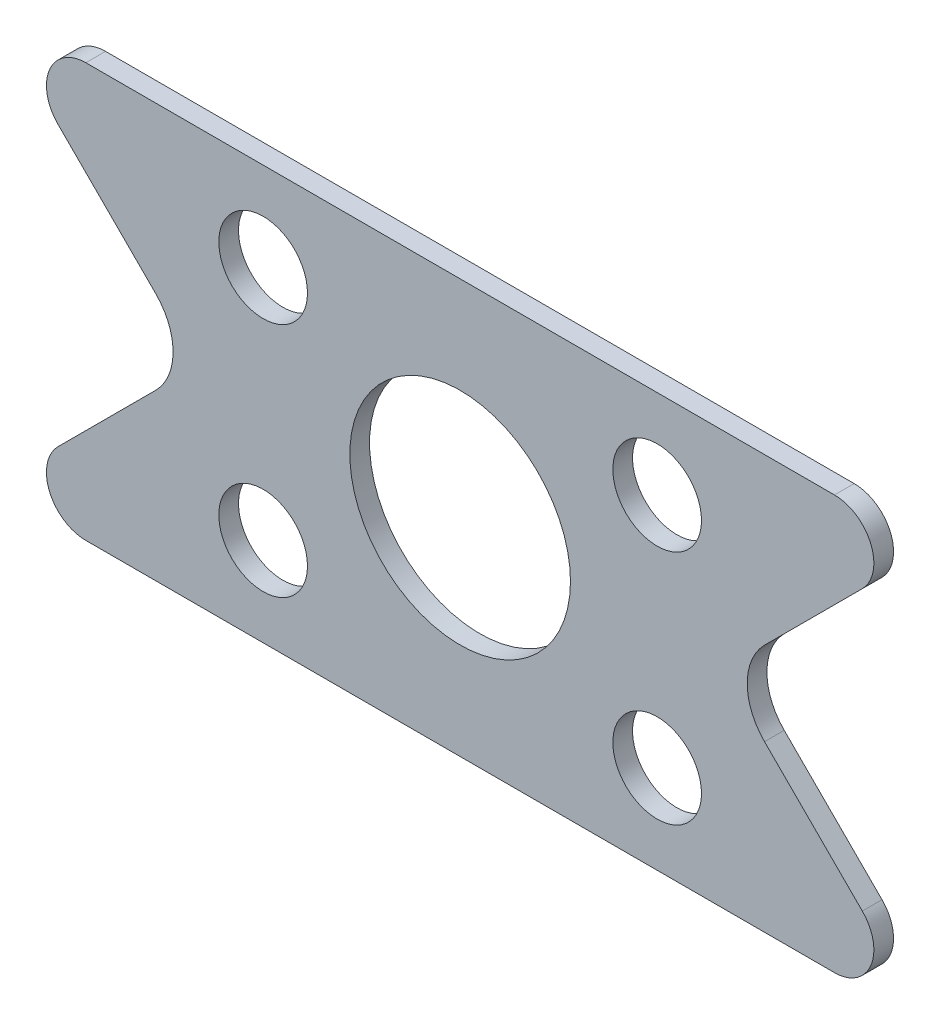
ISO-10303-21;
HEADER;
FILE_DESCRIPTION(('STEP AP214'),'2;1');
FILE_NAME('part.step','',(''),(''),'','','');
FILE_SCHEMA(('AUTOMOTIVE_DESIGN { 1 0 10303 214 1 1 1 1 }'));
ENDSEC;
DATA;
#1=APPLICATION_CONTEXT('core data for automotive mechanical design processes');
#2=APPLICATION_PROTOCOL_DEFINITION('international standard','automotive_design',2000,#1);
#3=PRODUCT_CONTEXT('',#1,'mechanical');
#4=PRODUCT('Part','Part','',(#3));
#5=PRODUCT_RELATED_PRODUCT_CATEGORY('part','',(#4));
#6=PRODUCT_DEFINITION_FORMATION('','',#4);
#7=PRODUCT_DEFINITION_CONTEXT('part definition',#1,'design');
#8=PRODUCT_DEFINITION('design','',#6,#7);
#9=PRODUCT_DEFINITION_SHAPE('','',#8);
#10=(LENGTH_UNIT() NAMED_UNIT(*) SI_UNIT(.MILLI.,.METRE.));
#11=(NAMED_UNIT(*) PLANE_ANGLE_UNIT() SI_UNIT($,.RADIAN.));
#12=(NAMED_UNIT(*) SI_UNIT($,.STERADIAN.) SOLID_ANGLE_UNIT());
#13=UNCERTAINTY_MEASURE_WITH_UNIT(LENGTH_MEASURE(1.E-05),#10,'distance_accuracy_value','');
#14=(GEOMETRIC_REPRESENTATION_CONTEXT(3) GLOBAL_UNCERTAINTY_ASSIGNED_CONTEXT((#13)) GLOBAL_UNIT_ASSIGNED_CONTEXT((#10,
#11,#12)) REPRESENTATION_CONTEXT('',''));
#15=CARTESIAN_POINT('',(0.,0.,0.));
#16=DIRECTION('',(0.,0.,1.));
#17=DIRECTION('',(1.,0.,0.));
#18=AXIS2_PLACEMENT_3D('',#15,#16,#17);
#19=CARTESIAN_POINT('',(-210.,-105.,10.));
#20=DIRECTION('',(0.,1.,0.));
#21=DIRECTION('',(0.,0.,1.));
#22=AXIS2_PLACEMENT_3D('',#19,#20,#21);
#23=PLANE('',#22);
#24=DIRECTION('',(0.,0.,1.));
#25=VECTOR('',#24,1.);
#26=CARTESIAN_POINT('',(-190.,-105.,0.));
#27=LINE('',#26,#25);
#28=CARTESIAN_POINT('',(-190.,-105.,0.));
#29=VERTEX_POINT('',#28);
#30=CARTESIAN_POINT('',(-190.,-105.,10.));
#31=VERTEX_POINT('',#30);
#32=EDGE_CURVE('E167',#29,#31,#27,.T.);
#33=ORIENTED_EDGE('',*,*,#32,.F.);
#34=DIRECTION('',(1.,0.,0.));
#35=VECTOR('',#34,1.);
#36=CARTESIAN_POINT('',(-210.,-105.,0.));
#37=LINE('',#36,#35);
#38=CARTESIAN_POINT('',(190.,-105.,0.));
#39=VERTEX_POINT('',#38);
#40=EDGE_CURVE('E242',#29,#39,#37,.T.);
#41=ORIENTED_EDGE('',*,*,#40,.T.);
#42=DIRECTION('',(0.,0.,1.));
#43=VECTOR('',#42,1.);
#44=CARTESIAN_POINT('',(190.,-105.,0.));
#45=LINE('',#44,#43);
#46=CARTESIAN_POINT('',(190.,-105.,10.));
#47=VERTEX_POINT('',#46);
#48=EDGE_CURVE('E208',#39,#47,#45,.T.);
#49=ORIENTED_EDGE('',*,*,#48,.T.);
#50=DIRECTION('',(1.,0.,0.));
#51=VECTOR('',#50,1.);
#52=CARTESIAN_POINT('',(-210.,-105.,10.));
#53=LINE('',#52,#51);
#54=EDGE_CURVE('E38',#31,#47,#53,.T.);
#55=ORIENTED_EDGE('',*,*,#54,.F.);
#56=EDGE_LOOP('',(#33,#41,#49,#55));
#57=FACE_BOUND('',#56,.T.);
#58=ADVANCED_FACE('F30',(#57),#23,.F.);
#59=CARTESIAN_POINT('',(-210.,-105.,10.));
#60=DIRECTION('',(0.,0.,-1.));
#61=DIRECTION('',(-1.,0.,0.));
#62=AXIS2_PLACEMENT_3D('',#59,#60,#61);
#63=PLANE('',#62);
#64=CARTESIAN_POINT('',(-100.,60.,10.));
#65=DIRECTION('',(0.,0.,1.));
#66=DIRECTION('',(1.,0.,0.));
#67=AXIS2_PLACEMENT_3D('',#64,#65,#66);
#68=CIRCLE('',#67,22.5);
#69=CARTESIAN_POINT('',(-77.5,60.,10.));
#70=VERTEX_POINT('',#69);
#71=EDGE_CURVE('E215',#70,#70,#68,.T.);
#72=ORIENTED_EDGE('',*,*,#71,.F.);
#73=EDGE_LOOP('',(#72));
#74=FACE_BOUND('',#73,.T.);
#75=CARTESIAN_POINT('',(100.,-60.,10.));
#76=DIRECTION('',(0.,0.,1.));
#77=DIRECTION('',(1.,0.,0.));
#78=AXIS2_PLACEMENT_3D('',#75,#76,#77);
#79=CIRCLE('',#78,22.5);
#80=CARTESIAN_POINT('',(122.5,-60.,10.));
#81=VERTEX_POINT('',#80);
#82=EDGE_CURVE('E227',#81,#81,#79,.T.);
#83=ORIENTED_EDGE('',*,*,#82,.F.);
#84=EDGE_LOOP('',(#83));
#85=FACE_BOUND('',#84,.T.);
#86=CARTESIAN_POINT('',(0.,0.,10.));
#87=DIRECTION('',(0.,0.,1.));
#88=DIRECTION('',(1.,0.,0.));
#89=AXIS2_PLACEMENT_3D('',#86,#87,#88);
#90=CIRCLE('',#89,56.);
#91=CARTESIAN_POINT('',(56.,0.,10.));
#92=VERTEX_POINT('',#91);
#93=EDGE_CURVE('E239',#92,#92,#90,.T.);
#94=ORIENTED_EDGE('',*,*,#93,.F.);
#95=EDGE_LOOP('',(#94));
#96=FACE_BOUND('',#95,.T.);
#97=CARTESIAN_POINT('',(100.,60.,10.));
#98=DIRECTION('',(0.,0.,1.));
#99=DIRECTION('',(1.,0.,0.));
#100=AXIS2_PLACEMENT_3D('',#97,#98,#99);
#101=CIRCLE('',#100,22.5);
#102=CARTESIAN_POINT('',(122.5,60.,10.));
#103=VERTEX_POINT('',#102);
#104=EDGE_CURVE('E233',#103,#103,#101,.T.);
#105=ORIENTED_EDGE('',*,*,#104,.F.);
#106=EDGE_LOOP('',(#105));
#107=FACE_BOUND('',#106,.T.);
#108=CARTESIAN_POINT('',(-100.,-60.,10.));
#109=DIRECTION('',(0.,0.,1.));
#110=DIRECTION('',(1.,0.,0.));
#111=AXIS2_PLACEMENT_3D('',#108,#109,#110);
#112=CIRCLE('',#111,22.5);
#113=CARTESIAN_POINT('',(-77.5,-60.,10.));
#114=VERTEX_POINT('',#113);
#115=EDGE_CURVE('E221',#114,#114,#112,.T.);
#116=ORIENTED_EDGE('',*,*,#115,.F.);
#117=EDGE_LOOP('',(#116));
#118=FACE_BOUND('',#117,.T.);
#119=CARTESIAN_POINT('',(-190.,-85.,10.));
#120=DIRECTION('',(0.,0.,1.));
#121=DIRECTION('',(-1.,0.,0.));
#122=AXIS2_PLACEMENT_3D('',#119,#120,#121);
#123=CIRCLE('',#122,19.9999999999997);
#124=CARTESIAN_POINT('',(-204.142135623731,-70.8578643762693,10.));
#125=VERTEX_POINT('',#124);
#126=EDGE_CURVE('E150',#125,#31,#123,.T.);
#127=ORIENTED_EDGE('',*,*,#126,.T.);
#128=ORIENTED_EDGE('',*,*,#54,.T.);
#129=CARTESIAN_POINT('',(190.,-85.,10.));
#130=DIRECTION('',(0.,0.,-1.));
#131=DIRECTION('',(1.,0.,0.));
#132=AXIS2_PLACEMENT_3D('',#129,#130,#131);
#133=CIRCLE('',#132,19.9999999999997);
#134=CARTESIAN_POINT('',(204.142135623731,-70.8578643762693,10.));
#135=VERTEX_POINT('',#134);
#136=EDGE_CURVE('E193',#135,#47,#133,.T.);
#137=ORIENTED_EDGE('',*,*,#136,.F.);
#138=DIRECTION('',(0.707106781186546,-0.707106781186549,0.));
#139=VECTOR('',#138,1.);
#140=CARTESIAN_POINT('',(154.497474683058,-21.2132034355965,10.));
#141=LINE('',#140,#139);
#142=CARTESIAN_POINT('',(154.497474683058,-21.2132034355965,10.));
#143=VERTEX_POINT('',#142);
#144=EDGE_CURVE('E190',#143,#135,#141,.T.);
#145=ORIENTED_EDGE('',*,*,#144,.F.);
#146=CARTESIAN_POINT('',(175.710678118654,-1.43982048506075E-13,10.));
#147=DIRECTION('',(0.,0.,1.));
#148=DIRECTION('',(1.,0.,0.));
#149=AXIS2_PLACEMENT_3D('',#146,#147,#148);
#150=CIRCLE('',#149,30.);
#151=CARTESIAN_POINT('',(154.497474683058,21.2132034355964,10.));
#152=VERTEX_POINT('',#151);
#153=EDGE_CURVE('E164',#152,#143,#150,.T.);
#154=ORIENTED_EDGE('',*,*,#153,.F.);
#155=DIRECTION('',(-0.707106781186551,-0.707106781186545,0.));
#156=VECTOR('',#155,1.);
#157=CARTESIAN_POINT('',(204.142135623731,70.8578643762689,10.));
#158=LINE('',#157,#156);
#159=CARTESIAN_POINT('',(204.142135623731,70.8578643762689,10.));
#160=VERTEX_POINT('',#159);
#161=EDGE_CURVE('E177',#160,#152,#158,.T.);
#162=ORIENTED_EDGE('',*,*,#161,.F.);
#163=CARTESIAN_POINT('',(190.,85.,10.));
#164=DIRECTION('',(0.,0.,-1.));
#165=DIRECTION('',(1.,0.,0.));
#166=AXIS2_PLACEMENT_3D('',#163,#164,#165);
#167=CIRCLE('',#166,20.);
#168=CARTESIAN_POINT('',(190.,105.,10.));
#169=VERTEX_POINT('',#168);
#170=EDGE_CURVE('E196',#169,#160,#167,.T.);
#171=ORIENTED_EDGE('',*,*,#170,.F.);
#172=DIRECTION('',(-1.,0.,0.));
#173=VECTOR('',#172,1.);
#174=CARTESIAN_POINT('',(-210.,105.,10.));
#175=LINE('',#174,#173);
#176=CARTESIAN_POINT('',(-190.,105.,10.));
#177=VERTEX_POINT('',#176);
#178=EDGE_CURVE('E11',#169,#177,#175,.T.);
#179=ORIENTED_EDGE('',*,*,#178,.T.);
#180=CARTESIAN_POINT('',(-190.,85.,10.));
#181=DIRECTION('',(0.,0.,1.));
#182=DIRECTION('',(-1.,0.,0.));
#183=AXIS2_PLACEMENT_3D('',#180,#181,#182);
#184=CIRCLE('',#183,20.);
#185=CARTESIAN_POINT('',(-204.142135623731,70.8578643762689,10.));
#186=VERTEX_POINT('',#185);
#187=EDGE_CURVE('E46',#177,#186,#184,.T.);
#188=ORIENTED_EDGE('',*,*,#187,.T.);
#189=DIRECTION('',(0.707106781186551,-0.707106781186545,0.));
#190=VECTOR('',#189,1.);
#191=CARTESIAN_POINT('',(-204.142135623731,70.8578643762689,10.));
#192=LINE('',#191,#190);
#193=CARTESIAN_POINT('',(-154.497474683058,21.2132034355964,10.));
#194=VERTEX_POINT('',#193);
#195=EDGE_CURVE('E158',#186,#194,#192,.T.);
#196=ORIENTED_EDGE('',*,*,#195,.T.);
#197=CARTESIAN_POINT('',(-175.710678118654,-1.43982048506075E-13,10.));
#198=DIRECTION('',(0.,0.,-1.));
#199=DIRECTION('',(-1.,0.,0.));
#200=AXIS2_PLACEMENT_3D('',#197,#198,#199);
#201=CIRCLE('',#200,30.);
#202=CARTESIAN_POINT('',(-154.497474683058,-21.2132034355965,10.));
#203=VERTEX_POINT('',#202);
#204=EDGE_CURVE('E139',#194,#203,#201,.T.);
#205=ORIENTED_EDGE('',*,*,#204,.T.);
#206=DIRECTION('',(-0.707106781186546,-0.707106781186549,0.));
#207=VECTOR('',#206,1.);
#208=CARTESIAN_POINT('',(-154.497474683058,-21.2132034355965,10.));
#209=LINE('',#208,#207);
#210=EDGE_CURVE('E147',#203,#125,#209,.T.);
#211=ORIENTED_EDGE('',*,*,#210,.T.);
#212=EDGE_LOOP('',(#127,#128,#137,#145,#154,#162,#171,#179,#188,#196,#205,#211));
#213=FACE_BOUND('',#212,.T.);
#214=ADVANCED_FACE('F255',(#74,#85,#96,#107,#118,#213),#63,.F.);
#215=CARTESIAN_POINT('',(-210.,-105.,0.));
#216=DIRECTION('',(0.,0.,-1.));
#217=DIRECTION('',(-1.,0.,0.));
#218=AXIS2_PLACEMENT_3D('',#215,#216,#217);
#219=PLANE('',#218);
#220=CARTESIAN_POINT('',(-100.,60.,0.));
#221=DIRECTION('',(0.,0.,1.));
#222=DIRECTION('',(1.,0.,0.));
#223=AXIS2_PLACEMENT_3D('',#220,#221,#222);
#224=CIRCLE('',#223,22.5);
#225=CARTESIAN_POINT('',(-77.5,60.,0.));
#226=VERTEX_POINT('',#225);
#227=EDGE_CURVE('E202',#226,#226,#224,.T.);
#228=ORIENTED_EDGE('',*,*,#227,.T.);
#229=EDGE_LOOP('',(#228));
#230=FACE_BOUND('',#229,.T.);
#231=CARTESIAN_POINT('',(100.,-60.,0.));
#232=DIRECTION('',(0.,0.,1.));
#233=DIRECTION('',(1.,0.,0.));
#234=AXIS2_PLACEMENT_3D('',#231,#232,#233);
#235=CIRCLE('',#234,22.5);
#236=CARTESIAN_POINT('',(122.5,-60.,0.));
#237=VERTEX_POINT('',#236);
#238=EDGE_CURVE('E224',#237,#237,#235,.T.);
#239=ORIENTED_EDGE('',*,*,#238,.T.);
#240=EDGE_LOOP('',(#239));
#241=FACE_BOUND('',#240,.T.);
#242=CARTESIAN_POINT('',(0.,0.,0.));
#243=DIRECTION('',(0.,0.,1.));
#244=DIRECTION('',(1.,0.,0.));
#245=AXIS2_PLACEMENT_3D('',#242,#243,#244);
#246=CIRCLE('',#245,56.);
#247=CARTESIAN_POINT('',(56.,0.,0.));
#248=VERTEX_POINT('',#247);
#249=EDGE_CURVE('E236',#248,#248,#246,.T.);
#250=ORIENTED_EDGE('',*,*,#249,.T.);
#251=EDGE_LOOP('',(#250));
#252=FACE_BOUND('',#251,.T.);
#253=CARTESIAN_POINT('',(100.,60.,0.));
#254=DIRECTION('',(0.,0.,1.));
#255=DIRECTION('',(1.,0.,0.));
#256=AXIS2_PLACEMENT_3D('',#253,#254,#255);
#257=CIRCLE('',#256,22.5);
#258=CARTESIAN_POINT('',(122.5,60.,0.));
#259=VERTEX_POINT('',#258);
#260=EDGE_CURVE('E230',#259,#259,#257,.T.);
#261=ORIENTED_EDGE('',*,*,#260,.T.);
#262=EDGE_LOOP('',(#261));
#263=FACE_BOUND('',#262,.T.);
#264=CARTESIAN_POINT('',(-100.,-60.,0.));
#265=DIRECTION('',(0.,0.,1.));
#266=DIRECTION('',(1.,0.,0.));
#267=AXIS2_PLACEMENT_3D('',#264,#265,#266);
#268=CIRCLE('',#267,22.5);
#269=CARTESIAN_POINT('',(-77.5,-60.,0.));
#270=VERTEX_POINT('',#269);
#271=EDGE_CURVE('E218',#270,#270,#268,.T.);
#272=ORIENTED_EDGE('',*,*,#271,.T.);
#273=EDGE_LOOP('',(#272));
#274=FACE_BOUND('',#273,.T.);
#275=ORIENTED_EDGE('',*,*,#40,.F.);
#276=CARTESIAN_POINT('',(-190.,-85.,0.));
#277=DIRECTION('',(0.,0.,1.));
#278=DIRECTION('',(-1.,0.,0.));
#279=AXIS2_PLACEMENT_3D('',#276,#277,#278);
#280=CIRCLE('',#279,19.9999999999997);
#281=CARTESIAN_POINT('',(-204.142135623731,-70.8578643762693,0.));
#282=VERTEX_POINT('',#281);
#283=EDGE_CURVE('E154',#282,#29,#280,.T.);
#284=ORIENTED_EDGE('',*,*,#283,.F.);
#285=DIRECTION('',(-0.707106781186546,-0.707106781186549,0.));
#286=VECTOR('',#285,1.);
#287=CARTESIAN_POINT('',(-154.497474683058,-21.2132034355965,0.));
#288=LINE('',#287,#286);
#289=CARTESIAN_POINT('',(-154.497474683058,-21.2132034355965,0.));
#290=VERTEX_POINT('',#289);
#291=EDGE_CURVE('E141',#290,#282,#288,.T.);
#292=ORIENTED_EDGE('',*,*,#291,.F.);
#293=CARTESIAN_POINT('',(-175.710678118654,-1.43982048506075E-13,0.));
#294=DIRECTION('',(0.,0.,-1.));
#295=DIRECTION('',(-1.,0.,0.));
#296=AXIS2_PLACEMENT_3D('',#293,#294,#295);
#297=CIRCLE('',#296,30.);
#298=CARTESIAN_POINT('',(-154.497474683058,21.2132034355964,0.));
#299=VERTEX_POINT('',#298);
#300=EDGE_CURVE('E132',#299,#290,#297,.T.);
#301=ORIENTED_EDGE('',*,*,#300,.F.);
#302=DIRECTION('',(0.707106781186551,-0.707106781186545,0.));
#303=VECTOR('',#302,1.);
#304=CARTESIAN_POINT('',(-204.142135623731,70.8578643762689,0.));
#305=LINE('',#304,#303);
#306=CARTESIAN_POINT('',(-204.142135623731,70.8578643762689,0.));
#307=VERTEX_POINT('',#306);
#308=EDGE_CURVE('E121',#307,#299,#305,.T.);
#309=ORIENTED_EDGE('',*,*,#308,.F.);
#310=CARTESIAN_POINT('',(-190.,85.,0.));
#311=DIRECTION('',(0.,0.,1.));
#312=DIRECTION('',(-1.,0.,0.));
#313=AXIS2_PLACEMENT_3D('',#310,#311,#312);
#314=CIRCLE('',#313,20.);
#315=CARTESIAN_POINT('',(-190.,105.,0.));
#316=VERTEX_POINT('',#315);
#317=EDGE_CURVE('E131',#316,#307,#314,.T.);
#318=ORIENTED_EDGE('',*,*,#317,.F.);
#319=DIRECTION('',(-1.,0.,0.));
#320=VECTOR('',#319,1.);
#321=CARTESIAN_POINT('',(-210.,105.,0.));
#322=LINE('',#321,#320);
#323=CARTESIAN_POINT('',(190.,105.,0.));
#324=VERTEX_POINT('',#323);
#325=EDGE_CURVE('E33',#324,#316,#322,.T.);
#326=ORIENTED_EDGE('',*,*,#325,.F.);
#327=CARTESIAN_POINT('',(190.,85.,0.));
#328=DIRECTION('',(0.,0.,-1.));
#329=DIRECTION('',(1.,0.,0.));
#330=AXIS2_PLACEMENT_3D('',#327,#328,#329);
#331=CIRCLE('',#330,20.);
#332=CARTESIAN_POINT('',(204.142135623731,70.8578643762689,0.));
#333=VERTEX_POINT('',#332);
#334=EDGE_CURVE('E54',#324,#333,#331,.T.);
#335=ORIENTED_EDGE('',*,*,#334,.T.);
#336=DIRECTION('',(-0.707106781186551,-0.707106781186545,0.));
#337=VECTOR('',#336,1.);
#338=CARTESIAN_POINT('',(204.142135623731,70.8578643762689,0.));
#339=LINE('',#338,#337);
#340=CARTESIAN_POINT('',(154.497474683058,21.2132034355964,0.));
#341=VERTEX_POINT('',#340);
#342=EDGE_CURVE('E184',#333,#341,#339,.T.);
#343=ORIENTED_EDGE('',*,*,#342,.T.);
#344=CARTESIAN_POINT('',(175.710678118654,-1.43982048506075E-13,0.));
#345=DIRECTION('',(0.,0.,1.));
#346=DIRECTION('',(1.,0.,0.));
#347=AXIS2_PLACEMENT_3D('',#344,#345,#346);
#348=CIRCLE('',#347,30.);
#349=CARTESIAN_POINT('',(154.497474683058,-21.2132034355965,0.));
#350=VERTEX_POINT('',#349);
#351=EDGE_CURVE('E173',#341,#350,#348,.T.);
#352=ORIENTED_EDGE('',*,*,#351,.T.);
#353=DIRECTION('',(0.707106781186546,-0.707106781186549,0.));
#354=VECTOR('',#353,1.);
#355=CARTESIAN_POINT('',(154.497474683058,-21.2132034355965,0.));
#356=LINE('',#355,#354);
#357=CARTESIAN_POINT('',(204.142135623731,-70.8578643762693,0.));
#358=VERTEX_POINT('',#357);
#359=EDGE_CURVE('E176',#350,#358,#356,.T.);
#360=ORIENTED_EDGE('',*,*,#359,.T.);
#361=CARTESIAN_POINT('',(190.,-85.,0.));
#362=DIRECTION('',(0.,0.,-1.));
#363=DIRECTION('',(1.,0.,0.));
#364=AXIS2_PLACEMENT_3D('',#361,#362,#363);
#365=CIRCLE('',#364,19.9999999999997);
#366=EDGE_CURVE('E180',#358,#39,#365,.T.);
#367=ORIENTED_EDGE('',*,*,#366,.T.);
#368=EDGE_LOOP('',(#275,#284,#292,#301,#309,#318,#326,#335,#343,#352,#360,#367));
#369=FACE_BOUND('',#368,.T.);
#370=ADVANCED_FACE('F145',(#230,#241,#252,#263,#274,#369),#219,.T.);
#371=CARTESIAN_POINT('',(-210.,105.,10.));
#372=DIRECTION('',(0.,-1.,0.));
#373=DIRECTION('',(1.,0.,0.));
#374=AXIS2_PLACEMENT_3D('',#371,#372,#373);
#375=PLANE('',#374);
#376=ORIENTED_EDGE('',*,*,#325,.T.);
#377=DIRECTION('',(0.,0.,1.));
#378=VECTOR('',#377,1.);
#379=CARTESIAN_POINT('',(-190.,105.,0.));
#380=LINE('',#379,#378);
#381=EDGE_CURVE('E170',#316,#177,#380,.T.);
#382=ORIENTED_EDGE('',*,*,#381,.T.);
#383=ORIENTED_EDGE('',*,*,#178,.F.);
#384=DIRECTION('',(0.,0.,1.));
#385=VECTOR('',#384,1.);
#386=CARTESIAN_POINT('',(190.,105.,0.));
#387=LINE('',#386,#385);
#388=EDGE_CURVE('E206',#324,#169,#387,.T.);
#389=ORIENTED_EDGE('',*,*,#388,.F.);
#390=EDGE_LOOP('',(#376,#382,#383,#389));
#391=FACE_BOUND('',#390,.T.);
#392=ADVANCED_FACE('F251',(#391),#375,.F.);
#393=CARTESIAN_POINT('',(0.,0.,10.));
#394=DIRECTION('',(0.,0.,-1.));
#395=DIRECTION('',(-1.,0.,0.));
#396=AXIS2_PLACEMENT_3D('',#393,#394,#395);
#397=CYLINDRICAL_SURFACE('',#396,56.);
#398=ORIENTED_EDGE('',*,*,#93,.T.);
#399=EDGE_LOOP('',(#398));
#400=FACE_BOUND('',#399,.T.);
#401=ORIENTED_EDGE('',*,*,#249,.F.);
#402=EDGE_LOOP('',(#401));
#403=FACE_BOUND('',#402,.T.);
#404=ADVANCED_FACE('F329',(#400,#403),#397,.F.);
#405=CARTESIAN_POINT('',(100.,60.,10.));
#406=DIRECTION('',(0.,0.,-1.));
#407=DIRECTION('',(-1.,0.,0.));
#408=AXIS2_PLACEMENT_3D('',#405,#406,#407);
#409=CYLINDRICAL_SURFACE('',#408,22.5);
#410=ORIENTED_EDGE('',*,*,#104,.T.);
#411=EDGE_LOOP('',(#410));
#412=FACE_BOUND('',#411,.T.);
#413=ORIENTED_EDGE('',*,*,#260,.F.);
#414=EDGE_LOOP('',(#413));
#415=FACE_BOUND('',#414,.T.);
#416=ADVANCED_FACE('F325',(#412,#415),#409,.F.);
#417=CARTESIAN_POINT('',(100.,-60.,10.));
#418=DIRECTION('',(0.,0.,-1.));
#419=DIRECTION('',(-1.,0.,0.));
#420=AXIS2_PLACEMENT_3D('',#417,#418,#419);
#421=CYLINDRICAL_SURFACE('',#420,22.5);
#422=ORIENTED_EDGE('',*,*,#82,.T.);
#423=EDGE_LOOP('',(#422));
#424=FACE_BOUND('',#423,.T.);
#425=ORIENTED_EDGE('',*,*,#238,.F.);
#426=EDGE_LOOP('',(#425));
#427=FACE_BOUND('',#426,.T.);
#428=ADVANCED_FACE('F321',(#424,#427),#421,.F.);
#429=CARTESIAN_POINT('',(-100.,-60.,10.));
#430=DIRECTION('',(0.,0.,-1.));
#431=DIRECTION('',(-1.,0.,0.));
#432=AXIS2_PLACEMENT_3D('',#429,#430,#431);
#433=CYLINDRICAL_SURFACE('',#432,22.5);
#434=ORIENTED_EDGE('',*,*,#115,.T.);
#435=EDGE_LOOP('',(#434));
#436=FACE_BOUND('',#435,.T.);
#437=ORIENTED_EDGE('',*,*,#271,.F.);
#438=EDGE_LOOP('',(#437));
#439=FACE_BOUND('',#438,.T.);
#440=ADVANCED_FACE('F317',(#436,#439),#433,.F.);
#441=CARTESIAN_POINT('',(-100.,60.,10.));
#442=DIRECTION('',(0.,0.,-1.));
#443=DIRECTION('',(-1.,0.,0.));
#444=AXIS2_PLACEMENT_3D('',#441,#442,#443);
#445=CYLINDRICAL_SURFACE('',#444,22.5);
#446=ORIENTED_EDGE('',*,*,#71,.T.);
#447=EDGE_LOOP('',(#446));
#448=FACE_BOUND('',#447,.T.);
#449=ORIENTED_EDGE('',*,*,#227,.F.);
#450=EDGE_LOOP('',(#449));
#451=FACE_BOUND('',#450,.T.);
#452=ADVANCED_FACE('F270',(#448,#451),#445,.F.);
#453=CARTESIAN_POINT('',(190.,-85.,0.));
#454=DIRECTION('',(0.,0.,1.));
#455=DIRECTION('',(1.,0.,0.));
#456=AXIS2_PLACEMENT_3D('',#453,#454,#455);
#457=CYLINDRICAL_SURFACE('',#456,19.9999999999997);
#458=ORIENTED_EDGE('',*,*,#136,.T.);
#459=ORIENTED_EDGE('',*,*,#48,.F.);
#460=ORIENTED_EDGE('',*,*,#366,.F.);
#461=DIRECTION('',(0.,0.,1.));
#462=VECTOR('',#461,1.);
#463=CARTESIAN_POINT('',(204.142135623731,-70.8578643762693,0.));
#464=LINE('',#463,#462);
#465=EDGE_CURVE('E211',#358,#135,#464,.T.);
#466=ORIENTED_EDGE('',*,*,#465,.T.);
#467=EDGE_LOOP('',(#458,#459,#460,#466));
#468=FACE_BOUND('',#467,.T.);
#469=ADVANCED_FACE('F261',(#468),#457,.T.);
#470=CARTESIAN_POINT('',(190.,85.,0.));
#471=DIRECTION('',(0.,0.,1.));
#472=DIRECTION('',(1.,0.,0.));
#473=AXIS2_PLACEMENT_3D('',#470,#471,#472);
#474=CYLINDRICAL_SURFACE('',#473,20.);
#475=ORIENTED_EDGE('',*,*,#170,.T.);
#476=DIRECTION('',(0.,0.,1.));
#477=VECTOR('',#476,1.);
#478=CARTESIAN_POINT('',(204.142135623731,70.8578643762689,0.));
#479=LINE('',#478,#477);
#480=EDGE_CURVE('E203',#333,#160,#479,.T.);
#481=ORIENTED_EDGE('',*,*,#480,.F.);
#482=ORIENTED_EDGE('',*,*,#334,.F.);
#483=ORIENTED_EDGE('',*,*,#388,.T.);
#484=EDGE_LOOP('',(#475,#481,#482,#483));
#485=FACE_BOUND('',#484,.T.);
#486=ADVANCED_FACE('F258',(#485),#474,.T.);
#487=CARTESIAN_POINT('',(175.710678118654,-1.43982048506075E-13,0.));
#488=DIRECTION('',(0.,0.,1.));
#489=DIRECTION('',(1.,0.,0.));
#490=AXIS2_PLACEMENT_3D('',#487,#488,#489);
#491=CYLINDRICAL_SURFACE('',#490,30.);
#492=ORIENTED_EDGE('',*,*,#153,.T.);
#493=DIRECTION('',(0.,0.,1.));
#494=VECTOR('',#493,1.);
#495=CARTESIAN_POINT('',(154.497474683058,-21.2132034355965,0.));
#496=LINE('',#495,#494);
#497=EDGE_CURVE('E187',#350,#143,#496,.T.);
#498=ORIENTED_EDGE('',*,*,#497,.F.);
#499=ORIENTED_EDGE('',*,*,#351,.F.);
#500=DIRECTION('',(0.,0.,1.));
#501=VECTOR('',#500,1.);
#502=CARTESIAN_POINT('',(154.497474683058,21.2132034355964,0.));
#503=LINE('',#502,#501);
#504=EDGE_CURVE('E200',#341,#152,#503,.T.);
#505=ORIENTED_EDGE('',*,*,#504,.T.);
#506=EDGE_LOOP('',(#492,#498,#499,#505));
#507=FACE_BOUND('',#506,.T.);
#508=ADVANCED_FACE('F260',(#507),#491,.F.);
#509=CARTESIAN_POINT('',(204.142135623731,70.8578643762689,0.));
#510=DIRECTION('',(-0.707106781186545,0.707106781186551,0.));
#511=DIRECTION('',(-0.707106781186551,-0.707106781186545,0.));
#512=AXIS2_PLACEMENT_3D('',#509,#510,#511);
#513=PLANE('',#512);
#514=ORIENTED_EDGE('',*,*,#161,.T.);
#515=ORIENTED_EDGE('',*,*,#504,.F.);
#516=ORIENTED_EDGE('',*,*,#342,.F.);
#517=ORIENTED_EDGE('',*,*,#480,.T.);
#518=EDGE_LOOP('',(#514,#515,#516,#517));
#519=FACE_BOUND('',#518,.T.);
#520=ADVANCED_FACE('F267',(#519),#513,.F.);
#521=CARTESIAN_POINT('',(154.497474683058,-21.2132034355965,0.));
#522=DIRECTION('',(-0.707106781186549,-0.707106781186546,0.));
#523=DIRECTION('',(0.707106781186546,-0.707106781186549,0.));
#524=AXIS2_PLACEMENT_3D('',#521,#522,#523);
#525=PLANE('',#524);
#526=ORIENTED_EDGE('',*,*,#144,.T.);
#527=ORIENTED_EDGE('',*,*,#465,.F.);
#528=ORIENTED_EDGE('',*,*,#359,.F.);
#529=ORIENTED_EDGE('',*,*,#497,.T.);
#530=EDGE_LOOP('',(#526,#527,#528,#529));
#531=FACE_BOUND('',#530,.T.);
#532=ADVANCED_FACE('F286',(#531),#525,.F.);
#533=CARTESIAN_POINT('',(-190.,-85.,0.));
#534=DIRECTION('',(0.,0.,1.));
#535=DIRECTION('',(1.,0.,0.));
#536=AXIS2_PLACEMENT_3D('',#533,#534,#535);
#537=CYLINDRICAL_SURFACE('',#536,19.9999999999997);
#538=ORIENTED_EDGE('',*,*,#283,.T.);
#539=ORIENTED_EDGE('',*,*,#32,.T.);
#540=ORIENTED_EDGE('',*,*,#126,.F.);
#541=DIRECTION('',(0.,0.,1.));
#542=VECTOR('',#541,1.);
#543=CARTESIAN_POINT('',(-204.142135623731,-70.8578643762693,0.));
#544=LINE('',#543,#542);
#545=EDGE_CURVE('E165',#282,#125,#544,.T.);
#546=ORIENTED_EDGE('',*,*,#545,.F.);
#547=EDGE_LOOP('',(#538,#539,#540,#546));
#548=FACE_BOUND('',#547,.T.);
#549=ADVANCED_FACE('F289',(#548),#537,.T.);
#550=CARTESIAN_POINT('',(-190.,85.,0.));
#551=DIRECTION('',(0.,0.,1.));
#552=DIRECTION('',(1.,0.,0.));
#553=AXIS2_PLACEMENT_3D('',#550,#551,#552);
#554=CYLINDRICAL_SURFACE('',#553,20.);
#555=ORIENTED_EDGE('',*,*,#317,.T.);
#556=DIRECTION('',(0.,0.,1.));
#557=VECTOR('',#556,1.);
#558=CARTESIAN_POINT('',(-204.142135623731,70.8578643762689,0.));
#559=LINE('',#558,#557);
#560=EDGE_CURVE('E127',#307,#186,#559,.T.);
#561=ORIENTED_EDGE('',*,*,#560,.T.);
#562=ORIENTED_EDGE('',*,*,#187,.F.);
#563=ORIENTED_EDGE('',*,*,#381,.F.);
#564=EDGE_LOOP('',(#555,#561,#562,#563));
#565=FACE_BOUND('',#564,.T.);
#566=ADVANCED_FACE('F253',(#565),#554,.T.);
#567=CARTESIAN_POINT('',(-175.710678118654,-1.43982048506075E-13,0.));
#568=DIRECTION('',(0.,0.,1.));
#569=DIRECTION('',(1.,0.,0.));
#570=AXIS2_PLACEMENT_3D('',#567,#568,#569);
#571=CYLINDRICAL_SURFACE('',#570,30.);
#572=ORIENTED_EDGE('',*,*,#204,.F.);
#573=DIRECTION('',(0.,0.,1.));
#574=VECTOR('',#573,1.);
#575=CARTESIAN_POINT('',(-154.497474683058,21.2132034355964,0.));
#576=LINE('',#575,#574);
#577=EDGE_CURVE('E125',#299,#194,#576,.T.);
#578=ORIENTED_EDGE('',*,*,#577,.F.);
#579=ORIENTED_EDGE('',*,*,#300,.T.);
#580=DIRECTION('',(0.,0.,1.));
#581=VECTOR('',#580,1.);
#582=CARTESIAN_POINT('',(-154.497474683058,-21.2132034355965,0.));
#583=LINE('',#582,#581);
#584=EDGE_CURVE('E162',#290,#203,#583,.T.);
#585=ORIENTED_EDGE('',*,*,#584,.T.);
#586=EDGE_LOOP('',(#572,#578,#579,#585));
#587=FACE_BOUND('',#586,.T.);
#588=ADVANCED_FACE('F135',(#587),#571,.F.);
#589=CARTESIAN_POINT('',(-154.497474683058,-21.2132034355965,0.));
#590=DIRECTION('',(-0.707106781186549,0.707106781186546,0.));
#591=DIRECTION('',(-0.707106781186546,-0.707106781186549,0.));
#592=AXIS2_PLACEMENT_3D('',#589,#590,#591);
#593=PLANE('',#592);
#594=ORIENTED_EDGE('',*,*,#210,.F.);
#595=ORIENTED_EDGE('',*,*,#584,.F.);
#596=ORIENTED_EDGE('',*,*,#291,.T.);
#597=ORIENTED_EDGE('',*,*,#545,.T.);
#598=EDGE_LOOP('',(#594,#595,#596,#597));
#599=FACE_BOUND('',#598,.T.);
#600=ADVANCED_FACE('F291',(#599),#593,.T.);
#601=CARTESIAN_POINT('',(-204.142135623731,70.8578643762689,0.));
#602=DIRECTION('',(-0.707106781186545,-0.707106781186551,0.));
#603=DIRECTION('',(0.707106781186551,-0.707106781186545,0.));
#604=AXIS2_PLACEMENT_3D('',#601,#602,#603);
#605=PLANE('',#604);
#606=ORIENTED_EDGE('',*,*,#195,.F.);
#607=ORIENTED_EDGE('',*,*,#560,.F.);
#608=ORIENTED_EDGE('',*,*,#308,.T.);
#609=ORIENTED_EDGE('',*,*,#577,.T.);
#610=EDGE_LOOP('',(#606,#607,#608,#609));
#611=FACE_BOUND('',#610,.T.);
#612=ADVANCED_FACE('F124',(#611),#605,.T.);
#613=CLOSED_SHELL('',(#58,#214,#370,#392,#404,#416,#428,#440,#452,#469,#486,#508,#520,#532,#549,
#566,#588,#600,#612));
#614=MANIFOLD_SOLID_BREP('B2',#613);
#615=ADVANCED_BREP_SHAPE_REPRESENTATION('',(#18,#614),#14);
#616=SHAPE_DEFINITION_REPRESENTATION(#9,#615);
ENDSEC;
END-ISO-10303-21;
